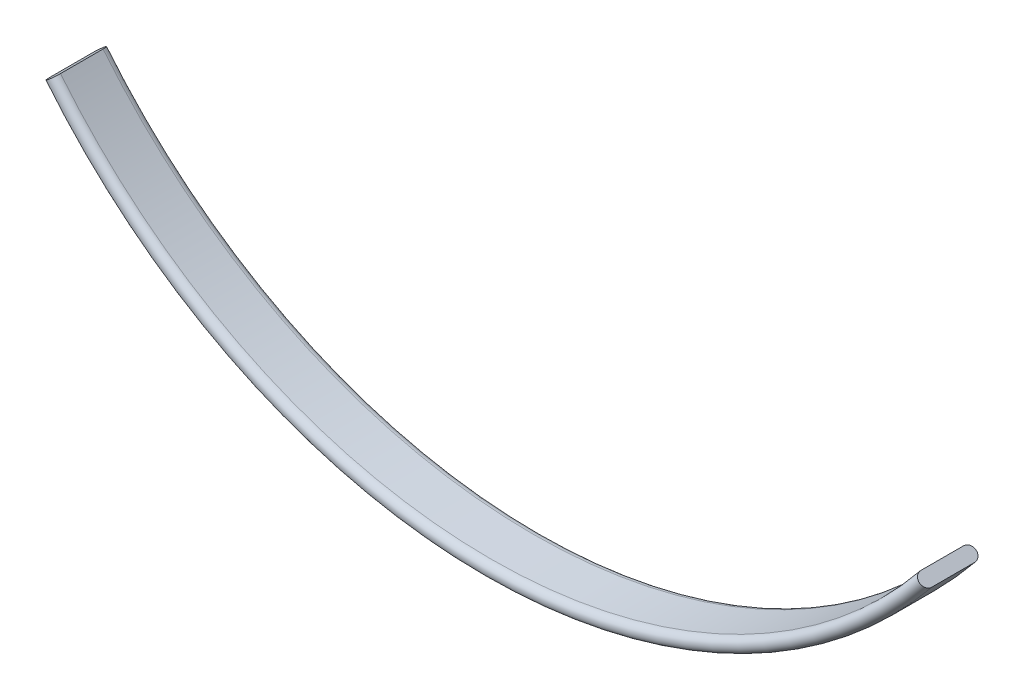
ISO-10303-21;
HEADER;
FILE_DESCRIPTION(('STEP AP214'),'2;1');
FILE_NAME('part.step','',(''),(''),'','','');
FILE_SCHEMA(('AUTOMOTIVE_DESIGN { 1 0 10303 214 1 1 1 1 }'));
ENDSEC;
DATA;
#1=APPLICATION_CONTEXT('core data for automotive mechanical design processes');
#2=APPLICATION_PROTOCOL_DEFINITION('international standard','automotive_design',2000,#1);
#3=PRODUCT_CONTEXT('',#1,'mechanical');
#4=PRODUCT('Part','Part','',(#3));
#5=PRODUCT_RELATED_PRODUCT_CATEGORY('part','',(#4));
#6=PRODUCT_DEFINITION_FORMATION('','',#4);
#7=PRODUCT_DEFINITION_CONTEXT('part definition',#1,'design');
#8=PRODUCT_DEFINITION('design','',#6,#7);
#9=PRODUCT_DEFINITION_SHAPE('','',#8);
#10=(LENGTH_UNIT() NAMED_UNIT(*) SI_UNIT(.MILLI.,.METRE.));
#11=(NAMED_UNIT(*) PLANE_ANGLE_UNIT() SI_UNIT($,.RADIAN.));
#12=(NAMED_UNIT(*) SI_UNIT($,.STERADIAN.) SOLID_ANGLE_UNIT());
#13=UNCERTAINTY_MEASURE_WITH_UNIT(LENGTH_MEASURE(1.E-05),#10,'distance_accuracy_value','');
#14=(GEOMETRIC_REPRESENTATION_CONTEXT(3) GLOBAL_UNCERTAINTY_ASSIGNED_CONTEXT((#13)) GLOBAL_UNIT_ASSIGNED_CONTEXT((#10,
#11,#12)) REPRESENTATION_CONTEXT('',''));
#15=CARTESIAN_POINT('',(0.,0.,0.));
#16=DIRECTION('',(0.,0.,1.));
#17=DIRECTION('',(1.,0.,0.));
#18=AXIS2_PLACEMENT_3D('',#15,#16,#17);
#19=CARTESIAN_POINT('',(0.,90.5000000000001,1.99999999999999));
#20=DIRECTION('',(0.,0.,-1.));
#21=DIRECTION('',(-1.,0.,0.));
#22=AXIS2_PLACEMENT_3D('',#19,#20,#21);
#23=TOROIDAL_SURFACE('',#22,158.,2.);
#24=CARTESIAN_POINT('',(0.,90.5000000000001,2.));
#25=DIRECTION('',(0.,0.,-1.));
#26=DIRECTION('',(-1.,0.,0.));
#27=AXIS2_PLACEMENT_3D('',#24,#25,#26);
#28=CIRCLE('',#27,156.);
#29=CARTESIAN_POINT('',(121.234769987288,-7.67398100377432,2.));
#30=VERTEX_POINT('',#29);
#31=CARTESIAN_POINT('',(-121.234769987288,-7.67398100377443,2.));
#32=VERTEX_POINT('',#31);
#33=EDGE_CURVE('E11',#30,#32,#28,.T.);
#34=ORIENTED_EDGE('',*,*,#33,.F.);
#35=CARTESIAN_POINT('',(122.789061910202,-8.93262178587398,1.99999999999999));
#36=DIRECTION('',(-0.629320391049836,-0.777145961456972,0.));
#37=DIRECTION('',(-0.777145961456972,0.629320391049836,0.));
#38=AXIS2_PLACEMENT_3D('',#35,#36,#37);
#39=CIRCLE('',#38,2.);
#40=CARTESIAN_POINT('',(124.343353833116,-10.1912625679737,2.));
#41=VERTEX_POINT('',#40);
#42=EDGE_CURVE('E76',#30,#41,#39,.T.);
#43=ORIENTED_EDGE('',*,*,#42,.T.);
#44=CARTESIAN_POINT('',(0.,90.5000000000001,2.));
#45=DIRECTION('',(0.,0.,-1.));
#46=DIRECTION('',(-1.,0.,0.));
#47=AXIS2_PLACEMENT_3D('',#44,#45,#46);
#48=CIRCLE('',#47,160.);
#49=CARTESIAN_POINT('',(-124.343353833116,-10.1912625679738,2.));
#50=VERTEX_POINT('',#49);
#51=EDGE_CURVE('E71',#41,#50,#48,.T.);
#52=ORIENTED_EDGE('',*,*,#51,.T.);
#53=CARTESIAN_POINT('',(-122.789061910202,-8.93262178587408,1.99999999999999));
#54=DIRECTION('',(-0.629320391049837,0.777145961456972,0.));
#55=DIRECTION('',(0.777145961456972,0.629320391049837,0.));
#56=AXIS2_PLACEMENT_3D('',#53,#54,#55);
#57=CIRCLE('',#56,2.);
#58=EDGE_CURVE('E74',#32,#50,#57,.T.);
#59=ORIENTED_EDGE('',*,*,#58,.F.);
#60=EDGE_LOOP('',(#34,#43,#52,#59));
#61=FACE_BOUND('',#60,.T.);
#62=ADVANCED_FACE('F35',(#61),#23,.T.);
#63=CARTESIAN_POINT('',(0.,90.5000000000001,16.1127424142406));
#64=DIRECTION('',(0.,0.,-1.));
#65=DIRECTION('',(-1.,0.,0.));
#66=AXIS2_PLACEMENT_3D('',#63,#64,#65);
#67=CYLINDRICAL_SURFACE('',#66,156.);
#68=CARTESIAN_POINT('',(0.,90.5000000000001,14.));
#69=DIRECTION('',(0.,0.,-1.));
#70=DIRECTION('',(-1.,0.,0.));
#71=AXIS2_PLACEMENT_3D('',#68,#69,#70);
#72=CIRCLE('',#71,156.);
#73=CARTESIAN_POINT('',(121.234769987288,-7.67398100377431,14.));
#74=VERTEX_POINT('',#73);
#75=CARTESIAN_POINT('',(-121.234769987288,-7.67398100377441,14.));
#76=VERTEX_POINT('',#75);
#77=EDGE_CURVE('E43',#74,#76,#72,.T.);
#78=ORIENTED_EDGE('',*,*,#77,.F.);
#79=DIRECTION('',(0.,0.,-1.));
#80=VECTOR('',#79,1.);
#81=CARTESIAN_POINT('',(121.234769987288,-7.67398100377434,14.));
#82=LINE('',#81,#80);
#83=EDGE_CURVE('E81',#74,#30,#82,.T.);
#84=ORIENTED_EDGE('',*,*,#83,.T.);
#85=ORIENTED_EDGE('',*,*,#33,.T.);
#86=DIRECTION('',(0.,0.,-1.));
#87=VECTOR('',#86,1.);
#88=CARTESIAN_POINT('',(-121.234769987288,-7.67398100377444,14.));
#89=LINE('',#88,#87);
#90=EDGE_CURVE('E93',#76,#32,#89,.T.);
#91=ORIENTED_EDGE('',*,*,#90,.F.);
#92=EDGE_LOOP('',(#78,#84,#85,#91));
#93=FACE_BOUND('',#92,.T.);
#94=ADVANCED_FACE('F37',(#93),#67,.F.);
#95=CARTESIAN_POINT('',(0.,90.5000000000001,14.));
#96=DIRECTION('',(0.,0.,-1.));
#97=DIRECTION('',(-1.,0.,0.));
#98=AXIS2_PLACEMENT_3D('',#95,#96,#97);
#99=TOROIDAL_SURFACE('',#98,158.,1.99999999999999);
#100=CARTESIAN_POINT('',(0.,90.5000000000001,14.));
#101=DIRECTION('',(0.,0.,-1.));
#102=DIRECTION('',(-1.,0.,0.));
#103=AXIS2_PLACEMENT_3D('',#100,#101,#102);
#104=CIRCLE('',#103,160.);
#105=CARTESIAN_POINT('',(124.343353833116,-10.1912625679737,14.));
#106=VERTEX_POINT('',#105);
#107=CARTESIAN_POINT('',(-124.343353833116,-10.1912625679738,14.));
#108=VERTEX_POINT('',#107);
#109=EDGE_CURVE('E80',#106,#108,#104,.T.);
#110=ORIENTED_EDGE('',*,*,#109,.F.);
#111=CARTESIAN_POINT('',(122.789061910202,-8.93262178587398,14.));
#112=DIRECTION('',(-0.629320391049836,-0.777145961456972,0.));
#113=DIRECTION('',(-0.777145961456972,0.629320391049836,0.));
#114=AXIS2_PLACEMENT_3D('',#111,#112,#113);
#115=CIRCLE('',#114,1.99999999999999);
#116=EDGE_CURVE('E101',#106,#74,#115,.T.);
#117=ORIENTED_EDGE('',*,*,#116,.T.);
#118=ORIENTED_EDGE('',*,*,#77,.T.);
#119=CARTESIAN_POINT('',(-122.789061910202,-8.93262178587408,14.));
#120=DIRECTION('',(-0.629320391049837,0.777145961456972,0.));
#121=DIRECTION('',(0.777145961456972,0.629320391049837,0.));
#122=AXIS2_PLACEMENT_3D('',#119,#120,#121);
#123=CIRCLE('',#122,1.99999999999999);
#124=EDGE_CURVE('E89',#108,#76,#123,.T.);
#125=ORIENTED_EDGE('',*,*,#124,.F.);
#126=EDGE_LOOP('',(#110,#117,#118,#125));
#127=FACE_BOUND('',#126,.T.);
#128=ADVANCED_FACE('F105',(#127),#99,.T.);
#129=CARTESIAN_POINT('',(0.,90.5000000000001,16.1127424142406));
#130=DIRECTION('',(0.,0.,-1.));
#131=DIRECTION('',(-1.,0.,0.));
#132=AXIS2_PLACEMENT_3D('',#129,#130,#131);
#133=CYLINDRICAL_SURFACE('',#132,160.);
#134=DIRECTION('',(0.,0.,1.));
#135=VECTOR('',#134,1.);
#136=CARTESIAN_POINT('',(124.343353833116,-10.1912625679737,2.));
#137=LINE('',#136,#135);
#138=EDGE_CURVE('E99',#41,#106,#137,.T.);
#139=ORIENTED_EDGE('',*,*,#138,.T.);
#140=ORIENTED_EDGE('',*,*,#109,.T.);
#141=DIRECTION('',(0.,0.,1.));
#142=VECTOR('',#141,1.);
#143=CARTESIAN_POINT('',(-124.343353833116,-10.1912625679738,2.));
#144=LINE('',#143,#142);
#145=EDGE_CURVE('E84',#50,#108,#144,.T.);
#146=ORIENTED_EDGE('',*,*,#145,.F.);
#147=ORIENTED_EDGE('',*,*,#51,.F.);
#148=EDGE_LOOP('',(#139,#140,#146,#147));
#149=FACE_BOUND('',#148,.T.);
#150=ADVANCED_FACE('F85',(#149),#133,.T.);
#151=CARTESIAN_POINT('',(122.789061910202,-8.93262178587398,1.99999999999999));
#152=DIRECTION('',(0.629320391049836,0.777145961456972,0.));
#153=DIRECTION('',(-0.777145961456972,0.629320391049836,0.));
#154=AXIS2_PLACEMENT_3D('',#151,#152,#153);
#155=PLANE('',#154);
#156=ORIENTED_EDGE('',*,*,#42,.F.);
#157=ORIENTED_EDGE('',*,*,#83,.F.);
#158=ORIENTED_EDGE('',*,*,#116,.F.);
#159=ORIENTED_EDGE('',*,*,#138,.F.);
#160=EDGE_LOOP('',(#156,#157,#158,#159));
#161=FACE_BOUND('',#160,.T.);
#162=ADVANCED_FACE('F109',(#161),#155,.T.);
#163=CARTESIAN_POINT('',(-122.789061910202,-8.93262178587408,1.99999999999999));
#164=DIRECTION('',(0.629320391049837,-0.777145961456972,0.));
#165=DIRECTION('',(0.777145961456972,0.629320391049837,0.));
#166=AXIS2_PLACEMENT_3D('',#163,#164,#165);
#167=PLANE('',#166);
#168=ORIENTED_EDGE('',*,*,#58,.T.);
#169=ORIENTED_EDGE('',*,*,#145,.T.);
#170=ORIENTED_EDGE('',*,*,#124,.T.);
#171=ORIENTED_EDGE('',*,*,#90,.T.);
#172=EDGE_LOOP('',(#168,#169,#170,#171));
#173=FACE_BOUND('',#172,.T.);
#174=ADVANCED_FACE('F92',(#173),#167,.F.);
#175=CLOSED_SHELL('',(#62,#94,#128,#150,#162,#174));
#176=MANIFOLD_SOLID_BREP('B2',#175);
#177=ADVANCED_BREP_SHAPE_REPRESENTATION('',(#18,#176),#14);
#178=SHAPE_DEFINITION_REPRESENTATION(#9,#177);
ENDSEC;
END-ISO-10303-21;
